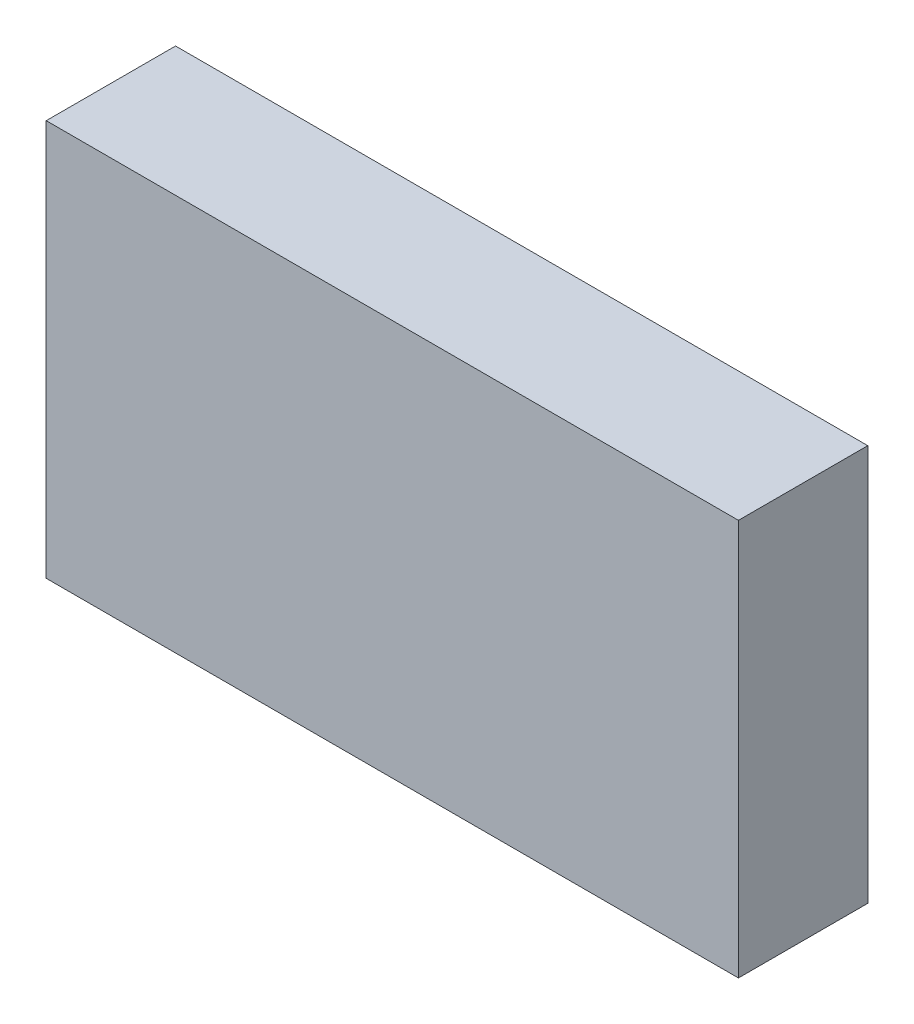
ISO-10303-21;
HEADER;
FILE_DESCRIPTION(('STEP AP214'),'2;1');
FILE_NAME('part.step','',(''),(''),'','','');
FILE_SCHEMA(('AUTOMOTIVE_DESIGN { 1 0 10303 214 1 1 1 1 }'));
ENDSEC;
DATA;
#1=APPLICATION_CONTEXT('core data for automotive mechanical design processes');
#2=APPLICATION_PROTOCOL_DEFINITION('international standard','automotive_design',2000,#1);
#3=PRODUCT_CONTEXT('',#1,'mechanical');
#4=PRODUCT('Part','Part','',(#3));
#5=PRODUCT_RELATED_PRODUCT_CATEGORY('part','',(#4));
#6=PRODUCT_DEFINITION_FORMATION('','',#4);
#7=PRODUCT_DEFINITION_CONTEXT('part definition',#1,'design');
#8=PRODUCT_DEFINITION('design','',#6,#7);
#9=PRODUCT_DEFINITION_SHAPE('','',#8);
#10=(LENGTH_UNIT() NAMED_UNIT(*) SI_UNIT(.MILLI.,.METRE.));
#11=(NAMED_UNIT(*) PLANE_ANGLE_UNIT() SI_UNIT($,.RADIAN.));
#12=(NAMED_UNIT(*) SI_UNIT($,.STERADIAN.) SOLID_ANGLE_UNIT());
#13=UNCERTAINTY_MEASURE_WITH_UNIT(LENGTH_MEASURE(1.E-05),#10,'distance_accuracy_value','');
#14=(GEOMETRIC_REPRESENTATION_CONTEXT(3) GLOBAL_UNCERTAINTY_ASSIGNED_CONTEXT((#13)) GLOBAL_UNIT_ASSIGNED_CONTEXT((#10,
#11,#12)) REPRESENTATION_CONTEXT('',''));
#15=CARTESIAN_POINT('',(0.,0.,0.));
#16=DIRECTION('',(0.,0.,1.));
#17=DIRECTION('',(1.,0.,0.));
#18=AXIS2_PLACEMENT_3D('',#15,#16,#17);
#19=CARTESIAN_POINT('',(-543.814,311.3905,101.6));
#20=DIRECTION('',(0.,-1.,0.));
#21=DIRECTION('',(1.,0.,0.));
#22=AXIS2_PLACEMENT_3D('',#19,#20,#21);
#23=PLANE('',#22);
#24=DIRECTION('',(-1.,0.,0.));
#25=VECTOR('',#24,1.);
#26=CARTESIAN_POINT('',(-543.814,311.3905,-101.6));
#27=LINE('',#26,#25);
#28=CARTESIAN_POINT('',(543.814,311.3905,-101.6));
#29=VERTEX_POINT('',#28);
#30=CARTESIAN_POINT('',(-543.814,311.3905,-101.6));
#31=VERTEX_POINT('',#30);
#32=EDGE_CURVE('E114',#29,#31,#27,.T.);
#33=ORIENTED_EDGE('',*,*,#32,.T.);
#34=DIRECTION('',(0.,0.,-1.));
#35=VECTOR('',#34,1.);
#36=CARTESIAN_POINT('',(-543.814,311.3905,101.6));
#37=LINE('',#36,#35);
#38=CARTESIAN_POINT('',(-543.814,311.3905,101.6));
#39=VERTEX_POINT('',#38);
#40=EDGE_CURVE('E11',#39,#31,#37,.T.);
#41=ORIENTED_EDGE('',*,*,#40,.F.);
#42=DIRECTION('',(-1.,0.,0.));
#43=VECTOR('',#42,1.);
#44=CARTESIAN_POINT('',(-543.814,311.3905,101.6));
#45=LINE('',#44,#43);
#46=CARTESIAN_POINT('',(543.814,311.3905,101.6));
#47=VERTEX_POINT('',#46);
#48=EDGE_CURVE('E100',#47,#39,#45,.T.);
#49=ORIENTED_EDGE('',*,*,#48,.F.);
#50=DIRECTION('',(0.,0.,-1.));
#51=VECTOR('',#50,1.);
#52=CARTESIAN_POINT('',(543.814,311.3905,101.6));
#53=LINE('',#52,#51);
#54=EDGE_CURVE('E108',#47,#29,#53,.T.);
#55=ORIENTED_EDGE('',*,*,#54,.T.);
#56=EDGE_LOOP('',(#33,#41,#49,#55));
#57=FACE_BOUND('',#56,.T.);
#58=ADVANCED_FACE('F44',(#57),#23,.F.);
#59=CARTESIAN_POINT('',(-543.814,-311.3905,101.6));
#60=DIRECTION('',(1.,0.,0.));
#61=DIRECTION('',(0.,0.,-1.));
#62=AXIS2_PLACEMENT_3D('',#59,#60,#61);
#63=PLANE('',#62);
#64=DIRECTION('',(0.,-1.,0.));
#65=VECTOR('',#64,1.);
#66=CARTESIAN_POINT('',(-543.814,-311.3905,-101.6));
#67=LINE('',#66,#65);
#68=CARTESIAN_POINT('',(-543.814,-311.3905,-101.6));
#69=VERTEX_POINT('',#68);
#70=EDGE_CURVE('E105',#31,#69,#67,.T.);
#71=ORIENTED_EDGE('',*,*,#70,.T.);
#72=DIRECTION('',(0.,0.,-1.));
#73=VECTOR('',#72,1.);
#74=CARTESIAN_POINT('',(-543.814,-311.3905,101.6));
#75=LINE('',#74,#73);
#76=CARTESIAN_POINT('',(-543.814,-311.3905,101.6));
#77=VERTEX_POINT('',#76);
#78=EDGE_CURVE('E53',#77,#69,#75,.T.);
#79=ORIENTED_EDGE('',*,*,#78,.F.);
#80=DIRECTION('',(0.,-1.,0.));
#81=VECTOR('',#80,1.);
#82=CARTESIAN_POINT('',(-543.814,-311.3905,101.6));
#83=LINE('',#82,#81);
#84=EDGE_CURVE('E95',#39,#77,#83,.T.);
#85=ORIENTED_EDGE('',*,*,#84,.F.);
#86=ORIENTED_EDGE('',*,*,#40,.T.);
#87=EDGE_LOOP('',(#71,#79,#85,#86));
#88=FACE_BOUND('',#87,.T.);
#89=ADVANCED_FACE('F101',(#88),#63,.F.);
#90=CARTESIAN_POINT('',(-543.814,-311.3905,101.6));
#91=DIRECTION('',(0.,1.,0.));
#92=DIRECTION('',(-1.,0.,0.));
#93=AXIS2_PLACEMENT_3D('',#90,#91,#92);
#94=PLANE('',#93);
#95=DIRECTION('',(1.,0.,0.));
#96=VECTOR('',#95,1.);
#97=CARTESIAN_POINT('',(-543.814,-311.3905,-101.6));
#98=LINE('',#97,#96);
#99=CARTESIAN_POINT('',(543.814,-311.3905,-101.6));
#100=VERTEX_POINT('',#99);
#101=EDGE_CURVE('E76',#69,#100,#98,.T.);
#102=ORIENTED_EDGE('',*,*,#101,.T.);
#103=DIRECTION('',(0.,0.,-1.));
#104=VECTOR('',#103,1.);
#105=CARTESIAN_POINT('',(543.814,-311.3905,101.6));
#106=LINE('',#105,#104);
#107=CARTESIAN_POINT('',(543.814,-311.3905,101.6));
#108=VERTEX_POINT('',#107);
#109=EDGE_CURVE('E102',#108,#100,#106,.T.);
#110=ORIENTED_EDGE('',*,*,#109,.F.);
#111=DIRECTION('',(1.,0.,0.));
#112=VECTOR('',#111,1.);
#113=CARTESIAN_POINT('',(-543.814,-311.3905,101.6));
#114=LINE('',#113,#112);
#115=EDGE_CURVE('E92',#77,#108,#114,.T.);
#116=ORIENTED_EDGE('',*,*,#115,.F.);
#117=ORIENTED_EDGE('',*,*,#78,.T.);
#118=EDGE_LOOP('',(#102,#110,#116,#117));
#119=FACE_BOUND('',#118,.T.);
#120=ADVANCED_FACE('F104',(#119),#94,.F.);
#121=CARTESIAN_POINT('',(543.814,-311.3905,101.6));
#122=DIRECTION('',(-1.,0.,0.));
#123=DIRECTION('',(0.,0.,1.));
#124=AXIS2_PLACEMENT_3D('',#121,#122,#123);
#125=PLANE('',#124);
#126=DIRECTION('',(0.,1.,0.));
#127=VECTOR('',#126,1.);
#128=CARTESIAN_POINT('',(543.814,-311.3905,-101.6));
#129=LINE('',#128,#127);
#130=EDGE_CURVE('E81',#100,#29,#129,.T.);
#131=ORIENTED_EDGE('',*,*,#130,.T.);
#132=ORIENTED_EDGE('',*,*,#54,.F.);
#133=DIRECTION('',(0.,1.,0.));
#134=VECTOR('',#133,1.);
#135=CARTESIAN_POINT('',(543.814,-311.3905,101.6));
#136=LINE('',#135,#134);
#137=EDGE_CURVE('E65',#108,#47,#136,.T.);
#138=ORIENTED_EDGE('',*,*,#137,.F.);
#139=ORIENTED_EDGE('',*,*,#109,.T.);
#140=EDGE_LOOP('',(#131,#132,#138,#139));
#141=FACE_BOUND('',#140,.T.);
#142=ADVANCED_FACE('F127',(#141),#125,.F.);
#143=CARTESIAN_POINT('',(0.,0.,101.6));
#144=DIRECTION('',(0.,0.,1.));
#145=DIRECTION('',(1.,0.,0.));
#146=AXIS2_PLACEMENT_3D('',#143,#144,#145);
#147=PLANE('',#146);
#148=ORIENTED_EDGE('',*,*,#48,.T.);
#149=ORIENTED_EDGE('',*,*,#84,.T.);
#150=ORIENTED_EDGE('',*,*,#115,.T.);
#151=ORIENTED_EDGE('',*,*,#137,.T.);
#152=EDGE_LOOP('',(#148,#149,#150,#151));
#153=FACE_BOUND('',#152,.T.);
#154=ADVANCED_FACE('F91',(#153),#147,.T.);
#155=CARTESIAN_POINT('',(0.,0.,-101.6));
#156=DIRECTION('',(0.,0.,1.));
#157=DIRECTION('',(1.,0.,0.));
#158=AXIS2_PLACEMENT_3D('',#155,#156,#157);
#159=PLANE('',#158);
#160=ORIENTED_EDGE('',*,*,#32,.F.);
#161=ORIENTED_EDGE('',*,*,#130,.F.);
#162=ORIENTED_EDGE('',*,*,#101,.F.);
#163=ORIENTED_EDGE('',*,*,#70,.F.);
#164=EDGE_LOOP('',(#160,#161,#162,#163));
#165=FACE_BOUND('',#164,.T.);
#166=ADVANCED_FACE('F129',(#165),#159,.F.);
#167=CLOSED_SHELL('',(#58,#89,#120,#142,#154,#166));
#168=MANIFOLD_SOLID_BREP('B2',#167);
#169=ADVANCED_BREP_SHAPE_REPRESENTATION('',(#18,#168),#14);
#170=SHAPE_DEFINITION_REPRESENTATION(#9,#169);
ENDSEC;
END-ISO-10303-21;
